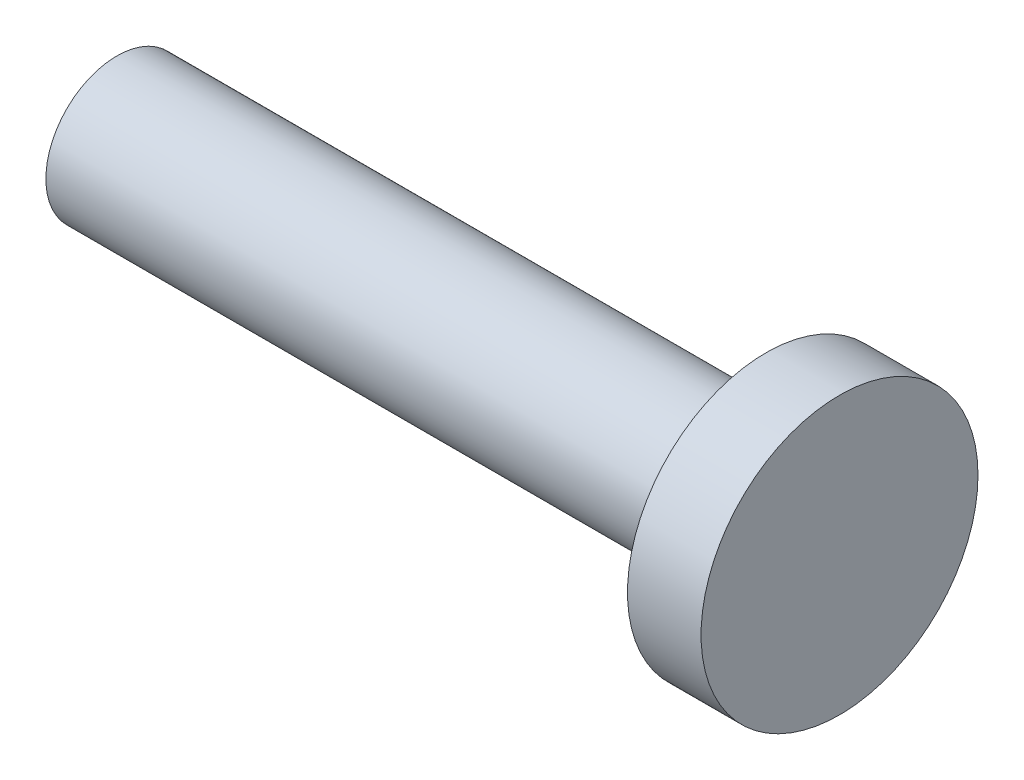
from build123d import *

# Parameters (mm, degrees)
SKETCH1_R              = 2.085
CIRCULAR_SECTION_DEPTH = 19.05
SKETCH2_R              = 4.064
BOSS_EXTRUDE2_DEPTH    = 2.159


with BuildPart() as part:
    # Sketch1 → Circular_section (new body)
    with BuildSketch(Plane.YZ):
        with Locations(Location((0, 0, 0), (0, 0, 270))):
            Circle(SKETCH1_R)
    extrude(amount=CIRCULAR_SECTION_DEPTH)

    # Sketch2 → Boss-Extrude2 (add)
    with BuildSketch(Plane.YZ.offset(19.05)):
        with Locations(Location((0, 0, 0), (0, 0, 270))):
            Circle(SKETCH2_R)
    extrude(amount=BOSS_EXTRUDE2_DEPTH)


solid = part.part
